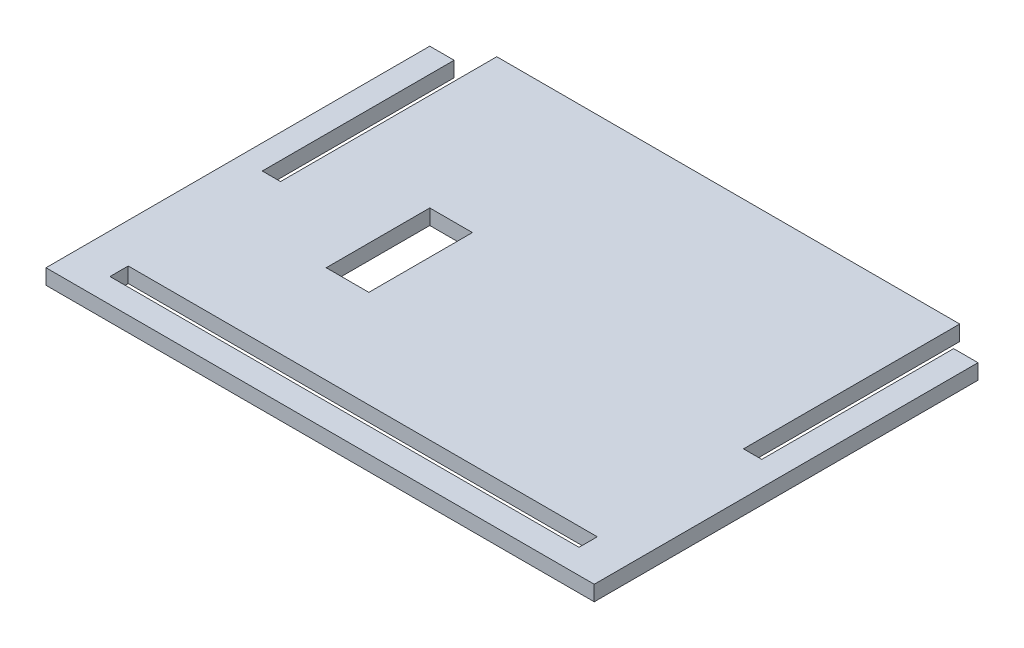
ISO-10303-21;
HEADER;
FILE_DESCRIPTION(('STEP AP214'),'2;1');
FILE_NAME('part.step','',(''),(''),'','','');
FILE_SCHEMA(('AUTOMOTIVE_DESIGN { 1 0 10303 214 1 1 1 1 }'));
ENDSEC;
DATA;
#1=APPLICATION_CONTEXT('core data for automotive mechanical design processes');
#2=APPLICATION_PROTOCOL_DEFINITION('international standard','automotive_design',2000,#1);
#3=PRODUCT_CONTEXT('',#1,'mechanical');
#4=PRODUCT('Part','Part','',(#3));
#5=PRODUCT_RELATED_PRODUCT_CATEGORY('part','',(#4));
#6=PRODUCT_DEFINITION_FORMATION('','',#4);
#7=PRODUCT_DEFINITION_CONTEXT('part definition',#1,'design');
#8=PRODUCT_DEFINITION('design','',#6,#7);
#9=PRODUCT_DEFINITION_SHAPE('','',#8);
#10=(LENGTH_UNIT() NAMED_UNIT(*) SI_UNIT(.MILLI.,.METRE.));
#11=(NAMED_UNIT(*) PLANE_ANGLE_UNIT() SI_UNIT($,.RADIAN.));
#12=(NAMED_UNIT(*) SI_UNIT($,.STERADIAN.) SOLID_ANGLE_UNIT());
#13=UNCERTAINTY_MEASURE_WITH_UNIT(LENGTH_MEASURE(1.E-05),#10,'distance_accuracy_value','');
#14=(GEOMETRIC_REPRESENTATION_CONTEXT(3) GLOBAL_UNCERTAINTY_ASSIGNED_CONTEXT((#13)) GLOBAL_UNIT_ASSIGNED_CONTEXT((#10,
#11,#12)) REPRESENTATION_CONTEXT('',''));
#15=CARTESIAN_POINT('',(0.,0.,0.));
#16=DIRECTION('',(0.,0.,1.));
#17=DIRECTION('',(1.,0.,0.));
#18=AXIS2_PLACEMENT_3D('',#15,#16,#17);
#19=CARTESIAN_POINT('',(0.,2.5,0.));
#20=DIRECTION('',(0.,1.,0.));
#21=DIRECTION('',(0.,0.,1.));
#22=AXIS2_PLACEMENT_3D('',#19,#20,#21);
#23=PLANE('',#22);
#24=DIRECTION('',(0.,0.,1.));
#25=VECTOR('',#24,1.);
#26=CARTESIAN_POINT('',(-22.,2.5,-7.50000000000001));
#27=LINE('',#26,#25);
#28=CARTESIAN_POINT('',(-22.,2.5,-8.50000000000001));
#29=VERTEX_POINT('',#28);
#30=CARTESIAN_POINT('',(-22.,2.5,8.49999999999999));
#31=VERTEX_POINT('',#30);
#32=EDGE_CURVE('E190',#29,#31,#27,.T.);
#33=ORIENTED_EDGE('',*,*,#32,.F.);
#34=DIRECTION('',(-1.,0.,0.));
#35=VECTOR('',#34,1.);
#36=CARTESIAN_POINT('',(-22.,2.5,-8.50000000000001));
#37=LINE('',#36,#35);
#38=CARTESIAN_POINT('',(-15.,2.5,-8.50000000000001));
#39=VERTEX_POINT('',#38);
#40=EDGE_CURVE('E199',#39,#29,#37,.T.);
#41=ORIENTED_EDGE('',*,*,#40,.F.);
#42=DIRECTION('',(0.,0.,-1.));
#43=VECTOR('',#42,1.);
#44=CARTESIAN_POINT('',(-15.,2.5,-7.50000000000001));
#45=LINE('',#44,#43);
#46=CARTESIAN_POINT('',(-15.,2.5,8.49999999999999));
#47=VERTEX_POINT('',#46);
#48=EDGE_CURVE('E184',#47,#39,#45,.T.);
#49=ORIENTED_EDGE('',*,*,#48,.F.);
#50=DIRECTION('',(1.,0.,0.));
#51=VECTOR('',#50,1.);
#52=CARTESIAN_POINT('',(-22.,2.5,8.49999999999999));
#53=LINE('',#52,#51);
#54=EDGE_CURVE('E203',#31,#47,#53,.T.);
#55=ORIENTED_EDGE('',*,*,#54,.F.);
#56=EDGE_LOOP('',(#33,#41,#49,#55));
#57=FACE_BOUND('',#56,.T.);
#58=DIRECTION('',(-1.,0.,0.));
#59=VECTOR('',#58,1.);
#60=CARTESIAN_POINT('',(-38.5,2.5,24.5));
#61=LINE('',#60,#59);
#62=CARTESIAN_POINT('',(38.5,2.5,24.5));
#63=VERTEX_POINT('',#62);
#64=CARTESIAN_POINT('',(-38.5,2.5,24.5));
#65=VERTEX_POINT('',#64);
#66=EDGE_CURVE('E230',#63,#65,#61,.T.);
#67=ORIENTED_EDGE('',*,*,#66,.F.);
#68=DIRECTION('',(0.,0.,-1.));
#69=VECTOR('',#68,1.);
#70=CARTESIAN_POINT('',(38.5,2.5,24.5));
#71=LINE('',#70,#69);
#72=CARTESIAN_POINT('',(38.5,2.5,27.5));
#73=VERTEX_POINT('',#72);
#74=EDGE_CURVE('E228',#73,#63,#71,.T.);
#75=ORIENTED_EDGE('',*,*,#74,.F.);
#76=DIRECTION('',(1.,0.,0.));
#77=VECTOR('',#76,1.);
#78=CARTESIAN_POINT('',(-38.5,2.5,27.5));
#79=LINE('',#78,#77);
#80=CARTESIAN_POINT('',(-38.5,2.5,27.5));
#81=VERTEX_POINT('',#80);
#82=EDGE_CURVE('E235',#81,#73,#79,.T.);
#83=ORIENTED_EDGE('',*,*,#82,.F.);
#84=DIRECTION('',(0.,0.,1.));
#85=VECTOR('',#84,1.);
#86=CARTESIAN_POINT('',(-38.5,2.5,24.5));
#87=LINE('',#86,#85);
#88=EDGE_CURVE('E233',#65,#81,#87,.T.);
#89=ORIENTED_EDGE('',*,*,#88,.F.);
#90=EDGE_LOOP('',(#67,#75,#83,#89));
#91=FACE_BOUND('',#90,.T.);
#92=DIRECTION('',(0.,0.,-1.));
#93=VECTOR('',#92,1.);
#94=CARTESIAN_POINT('',(45.,2.5,-31.5));
#95=LINE('',#94,#93);
#96=CARTESIAN_POINT('',(45.,2.5,31.5));
#97=VERTEX_POINT('',#96);
#98=CARTESIAN_POINT('',(45.,2.5,-31.5));
#99=VERTEX_POINT('',#98);
#100=EDGE_CURVE('E254',#97,#99,#95,.T.);
#101=ORIENTED_EDGE('',*,*,#100,.T.);
#102=DIRECTION('',(-1.,0.,0.));
#103=VECTOR('',#102,1.);
#104=CARTESIAN_POINT('',(41.,2.5,-31.5));
#105=LINE('',#104,#103);
#106=CARTESIAN_POINT('',(41.,2.5,-31.5));
#107=VERTEX_POINT('',#106);
#108=EDGE_CURVE('E257',#99,#107,#105,.T.);
#109=ORIENTED_EDGE('',*,*,#108,.T.);
#110=DIRECTION('',(0.,0.,1.));
#111=VECTOR('',#110,1.);
#112=CARTESIAN_POINT('',(41.,2.5,-31.5));
#113=LINE('',#112,#111);
#114=CARTESIAN_POINT('',(41.,2.5,0.));
#115=VERTEX_POINT('',#114);
#116=EDGE_CURVE('E260',#107,#115,#113,.T.);
#117=ORIENTED_EDGE('',*,*,#116,.T.);
#118=DIRECTION('',(-1.,0.,0.));
#119=VECTOR('',#118,1.);
#120=CARTESIAN_POINT('',(41.,2.5,0.));
#121=LINE('',#120,#119);
#122=CARTESIAN_POINT('',(38.,2.5,0.));
#123=VERTEX_POINT('',#122);
#124=EDGE_CURVE('E262',#115,#123,#121,.T.);
#125=ORIENTED_EDGE('',*,*,#124,.T.);
#126=DIRECTION('',(0.,0.,-1.));
#127=VECTOR('',#126,1.);
#128=CARTESIAN_POINT('',(38.,2.5,0.));
#129=LINE('',#128,#127);
#130=CARTESIAN_POINT('',(38.,2.5,-35.5));
#131=VERTEX_POINT('',#130);
#132=EDGE_CURVE('E264',#123,#131,#129,.T.);
#133=ORIENTED_EDGE('',*,*,#132,.T.);
#134=DIRECTION('',(-1.,0.,0.));
#135=VECTOR('',#134,1.);
#136=CARTESIAN_POINT('',(-38.,2.5,-35.5));
#137=LINE('',#136,#135);
#138=CARTESIAN_POINT('',(-38.,2.5,-35.5));
#139=VERTEX_POINT('',#138);
#140=EDGE_CURVE('E209',#131,#139,#137,.T.);
#141=ORIENTED_EDGE('',*,*,#140,.T.);
#142=DIRECTION('',(0.,0.,1.));
#143=VECTOR('',#142,1.);
#144=CARTESIAN_POINT('',(-38.,2.5,0.));
#145=LINE('',#144,#143);
#146=CARTESIAN_POINT('',(-38.,2.5,0.));
#147=VERTEX_POINT('',#146);
#148=EDGE_CURVE('E266',#139,#147,#145,.T.);
#149=ORIENTED_EDGE('',*,*,#148,.T.);
#150=DIRECTION('',(-1.,0.,0.));
#151=VECTOR('',#150,1.);
#152=CARTESIAN_POINT('',(-41.,2.5,0.));
#153=LINE('',#152,#151);
#154=CARTESIAN_POINT('',(-41.,2.5,0.));
#155=VERTEX_POINT('',#154);
#156=EDGE_CURVE('E268',#147,#155,#153,.T.);
#157=ORIENTED_EDGE('',*,*,#156,.T.);
#158=DIRECTION('',(0.,0.,-1.));
#159=VECTOR('',#158,1.);
#160=CARTESIAN_POINT('',(-41.,2.5,-31.5));
#161=LINE('',#160,#159);
#162=CARTESIAN_POINT('',(-41.,2.5,-31.5));
#163=VERTEX_POINT('',#162);
#164=EDGE_CURVE('E270',#155,#163,#161,.T.);
#165=ORIENTED_EDGE('',*,*,#164,.T.);
#166=DIRECTION('',(-1.,0.,0.));
#167=VECTOR('',#166,1.);
#168=CARTESIAN_POINT('',(-45.,2.5,-31.5));
#169=LINE('',#168,#167);
#170=CARTESIAN_POINT('',(-45.,2.5,-31.5));
#171=VERTEX_POINT('',#170);
#172=EDGE_CURVE('E272',#163,#171,#169,.T.);
#173=ORIENTED_EDGE('',*,*,#172,.T.);
#174=DIRECTION('',(0.,0.,1.));
#175=VECTOR('',#174,1.);
#176=CARTESIAN_POINT('',(-45.,2.5,-31.5));
#177=LINE('',#176,#175);
#178=CARTESIAN_POINT('',(-45.,2.5,31.5));
#179=VERTEX_POINT('',#178);
#180=EDGE_CURVE('E274',#171,#179,#177,.T.);
#181=ORIENTED_EDGE('',*,*,#180,.T.);
#182=DIRECTION('',(1.,0.,0.));
#183=VECTOR('',#182,1.);
#184=CARTESIAN_POINT('',(-45.,2.5,31.5));
#185=LINE('',#184,#183);
#186=EDGE_CURVE('E276',#179,#97,#185,.T.);
#187=ORIENTED_EDGE('',*,*,#186,.T.);
#188=EDGE_LOOP('',(#101,#109,#117,#125,#133,#141,#149,#157,#165,#173,#181,#187));
#189=FACE_BOUND('',#188,.T.);
#190=ADVANCED_FACE('F34',(#57,#91,#189),#23,.T.);
#191=CARTESIAN_POINT('',(0.,0.,0.));
#192=DIRECTION('',(0.,1.,0.));
#193=DIRECTION('',(0.,0.,1.));
#194=AXIS2_PLACEMENT_3D('',#191,#192,#193);
#195=PLANE('',#194);
#196=DIRECTION('',(-1.,0.,0.));
#197=VECTOR('',#196,1.);
#198=CARTESIAN_POINT('',(-22.,0.,-8.50000000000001));
#199=LINE('',#198,#197);
#200=CARTESIAN_POINT('',(-15.,0.,-8.50000000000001));
#201=VERTEX_POINT('',#200);
#202=CARTESIAN_POINT('',(-22.,0.,-8.50000000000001));
#203=VERTEX_POINT('',#202);
#204=EDGE_CURVE('E180',#201,#203,#199,.T.);
#205=ORIENTED_EDGE('',*,*,#204,.T.);
#206=DIRECTION('',(0.,0.,1.));
#207=VECTOR('',#206,1.);
#208=CARTESIAN_POINT('',(-22.,0.,-7.50000000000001));
#209=LINE('',#208,#207);
#210=CARTESIAN_POINT('',(-22.,0.,8.49999999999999));
#211=VERTEX_POINT('',#210);
#212=EDGE_CURVE('E173',#203,#211,#209,.T.);
#213=ORIENTED_EDGE('',*,*,#212,.T.);
#214=DIRECTION('',(1.,0.,0.));
#215=VECTOR('',#214,1.);
#216=CARTESIAN_POINT('',(-22.,0.,8.49999999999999));
#217=LINE('',#216,#215);
#218=CARTESIAN_POINT('',(-15.,0.,8.49999999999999));
#219=VERTEX_POINT('',#218);
#220=EDGE_CURVE('E178',#211,#219,#217,.T.);
#221=ORIENTED_EDGE('',*,*,#220,.T.);
#222=DIRECTION('',(0.,0.,-1.));
#223=VECTOR('',#222,1.);
#224=CARTESIAN_POINT('',(-15.,0.,-7.50000000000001));
#225=LINE('',#224,#223);
#226=EDGE_CURVE('E185',#219,#201,#225,.T.);
#227=ORIENTED_EDGE('',*,*,#226,.T.);
#228=EDGE_LOOP('',(#205,#213,#221,#227));
#229=FACE_BOUND('',#228,.T.);
#230=DIRECTION('',(0.,0.,-1.));
#231=VECTOR('',#230,1.);
#232=CARTESIAN_POINT('',(38.5,0.,24.5));
#233=LINE('',#232,#231);
#234=CARTESIAN_POINT('',(38.5,0.,27.5));
#235=VERTEX_POINT('',#234);
#236=CARTESIAN_POINT('',(38.5,0.,24.5));
#237=VERTEX_POINT('',#236);
#238=EDGE_CURVE('E57',#235,#237,#233,.T.);
#239=ORIENTED_EDGE('',*,*,#238,.T.);
#240=DIRECTION('',(-1.,0.,0.));
#241=VECTOR('',#240,1.);
#242=CARTESIAN_POINT('',(-38.5,0.,24.5));
#243=LINE('',#242,#241);
#244=CARTESIAN_POINT('',(-38.5,0.,24.5));
#245=VERTEX_POINT('',#244);
#246=EDGE_CURVE('E239',#237,#245,#243,.T.);
#247=ORIENTED_EDGE('',*,*,#246,.T.);
#248=DIRECTION('',(0.,0.,1.));
#249=VECTOR('',#248,1.);
#250=CARTESIAN_POINT('',(-38.5,0.,24.5));
#251=LINE('',#250,#249);
#252=CARTESIAN_POINT('',(-38.5,0.,27.5));
#253=VERTEX_POINT('',#252);
#254=EDGE_CURVE('E242',#245,#253,#251,.T.);
#255=ORIENTED_EDGE('',*,*,#254,.T.);
#256=DIRECTION('',(1.,0.,0.));
#257=VECTOR('',#256,1.);
#258=CARTESIAN_POINT('',(-38.5,0.,27.5));
#259=LINE('',#258,#257);
#260=EDGE_CURVE('E231',#253,#235,#259,.T.);
#261=ORIENTED_EDGE('',*,*,#260,.T.);
#262=EDGE_LOOP('',(#239,#247,#255,#261));
#263=FACE_BOUND('',#262,.T.);
#264=DIRECTION('',(0.,0.,-1.));
#265=VECTOR('',#264,1.);
#266=CARTESIAN_POINT('',(45.,0.,-31.5));
#267=LINE('',#266,#265);
#268=CARTESIAN_POINT('',(45.,0.,31.5));
#269=VERTEX_POINT('',#268);
#270=CARTESIAN_POINT('',(45.,0.,-31.5));
#271=VERTEX_POINT('',#270);
#272=EDGE_CURVE('E253',#269,#271,#267,.T.);
#273=ORIENTED_EDGE('',*,*,#272,.F.);
#274=DIRECTION('',(1.,0.,0.));
#275=VECTOR('',#274,1.);
#276=CARTESIAN_POINT('',(-45.,0.,31.5));
#277=LINE('',#276,#275);
#278=CARTESIAN_POINT('',(-45.,0.,31.5));
#279=VERTEX_POINT('',#278);
#280=EDGE_CURVE('E258',#279,#269,#277,.T.);
#281=ORIENTED_EDGE('',*,*,#280,.F.);
#282=DIRECTION('',(0.,0.,1.));
#283=VECTOR('',#282,1.);
#284=CARTESIAN_POINT('',(-45.,0.,-31.5));
#285=LINE('',#284,#283);
#286=CARTESIAN_POINT('',(-45.,0.,-31.5));
#287=VERTEX_POINT('',#286);
#288=EDGE_CURVE('E297',#287,#279,#285,.T.);
#289=ORIENTED_EDGE('',*,*,#288,.F.);
#290=DIRECTION('',(-1.,0.,0.));
#291=VECTOR('',#290,1.);
#292=CARTESIAN_POINT('',(-45.,0.,-31.5));
#293=LINE('',#292,#291);
#294=CARTESIAN_POINT('',(-41.,0.,-31.5));
#295=VERTEX_POINT('',#294);
#296=EDGE_CURVE('E295',#295,#287,#293,.T.);
#297=ORIENTED_EDGE('',*,*,#296,.F.);
#298=DIRECTION('',(0.,0.,-1.));
#299=VECTOR('',#298,1.);
#300=CARTESIAN_POINT('',(-41.,0.,-31.5));
#301=LINE('',#300,#299);
#302=CARTESIAN_POINT('',(-41.,0.,0.));
#303=VERTEX_POINT('',#302);
#304=EDGE_CURVE('E293',#303,#295,#301,.T.);
#305=ORIENTED_EDGE('',*,*,#304,.F.);
#306=DIRECTION('',(-1.,0.,0.));
#307=VECTOR('',#306,1.);
#308=CARTESIAN_POINT('',(-41.,0.,0.));
#309=LINE('',#308,#307);
#310=CARTESIAN_POINT('',(-38.,0.,0.));
#311=VERTEX_POINT('',#310);
#312=EDGE_CURVE('E291',#311,#303,#309,.T.);
#313=ORIENTED_EDGE('',*,*,#312,.F.);
#314=DIRECTION('',(0.,0.,1.));
#315=VECTOR('',#314,1.);
#316=CARTESIAN_POINT('',(-38.,0.,0.));
#317=LINE('',#316,#315);
#318=CARTESIAN_POINT('',(-38.,0.,-35.5));
#319=VERTEX_POINT('',#318);
#320=EDGE_CURVE('E289',#319,#311,#317,.T.);
#321=ORIENTED_EDGE('',*,*,#320,.F.);
#322=DIRECTION('',(-1.,0.,0.));
#323=VECTOR('',#322,1.);
#324=CARTESIAN_POINT('',(-38.,0.,-35.5));
#325=LINE('',#324,#323);
#326=CARTESIAN_POINT('',(38.,0.,-35.5));
#327=VERTEX_POINT('',#326);
#328=EDGE_CURVE('E214',#327,#319,#325,.T.);
#329=ORIENTED_EDGE('',*,*,#328,.F.);
#330=DIRECTION('',(0.,0.,-1.));
#331=VECTOR('',#330,1.);
#332=CARTESIAN_POINT('',(38.,0.,0.));
#333=LINE('',#332,#331);
#334=CARTESIAN_POINT('',(38.,0.,0.));
#335=VERTEX_POINT('',#334);
#336=EDGE_CURVE('E287',#335,#327,#333,.T.);
#337=ORIENTED_EDGE('',*,*,#336,.F.);
#338=DIRECTION('',(-1.,0.,0.));
#339=VECTOR('',#338,1.);
#340=CARTESIAN_POINT('',(41.,0.,0.));
#341=LINE('',#340,#339);
#342=CARTESIAN_POINT('',(41.,0.,0.));
#343=VERTEX_POINT('',#342);
#344=EDGE_CURVE('E285',#343,#335,#341,.T.);
#345=ORIENTED_EDGE('',*,*,#344,.F.);
#346=DIRECTION('',(0.,0.,1.));
#347=VECTOR('',#346,1.);
#348=CARTESIAN_POINT('',(41.,0.,-31.5));
#349=LINE('',#348,#347);
#350=CARTESIAN_POINT('',(41.,0.,-31.5));
#351=VERTEX_POINT('',#350);
#352=EDGE_CURVE('E283',#351,#343,#349,.T.);
#353=ORIENTED_EDGE('',*,*,#352,.F.);
#354=DIRECTION('',(-1.,0.,0.));
#355=VECTOR('',#354,1.);
#356=CARTESIAN_POINT('',(41.,0.,-31.5));
#357=LINE('',#356,#355);
#358=EDGE_CURVE('E281',#271,#351,#357,.T.);
#359=ORIENTED_EDGE('',*,*,#358,.F.);
#360=EDGE_LOOP('',(#273,#281,#289,#297,#305,#313,#321,#329,#337,#345,#353,#359));
#361=FACE_BOUND('',#360,.T.);
#362=ADVANCED_FACE('F175',(#229,#263,#361),#195,.F.);
#363=CARTESIAN_POINT('',(45.,2.5,-31.5));
#364=DIRECTION('',(-1.,0.,0.));
#365=DIRECTION('',(0.,0.,1.));
#366=AXIS2_PLACEMENT_3D('',#363,#364,#365);
#367=PLANE('',#366);
#368=ORIENTED_EDGE('',*,*,#272,.T.);
#369=DIRECTION('',(0.,-1.,0.));
#370=VECTOR('',#369,1.);
#371=CARTESIAN_POINT('',(45.,2.5,-31.5));
#372=LINE('',#371,#370);
#373=EDGE_CURVE('E11',#99,#271,#372,.T.);
#374=ORIENTED_EDGE('',*,*,#373,.F.);
#375=ORIENTED_EDGE('',*,*,#100,.F.);
#376=DIRECTION('',(0.,-1.,0.));
#377=VECTOR('',#376,1.);
#378=CARTESIAN_POINT('',(45.,2.5,31.5));
#379=LINE('',#378,#377);
#380=EDGE_CURVE('E278',#97,#269,#379,.T.);
#381=ORIENTED_EDGE('',*,*,#380,.T.);
#382=EDGE_LOOP('',(#368,#374,#375,#381));
#383=FACE_BOUND('',#382,.T.);
#384=ADVANCED_FACE('F36',(#383),#367,.F.);
#385=CARTESIAN_POINT('',(41.,2.5,-31.5));
#386=DIRECTION('',(0.,0.,1.));
#387=DIRECTION('',(1.,0.,0.));
#388=AXIS2_PLACEMENT_3D('',#385,#386,#387);
#389=PLANE('',#388);
#390=ORIENTED_EDGE('',*,*,#358,.T.);
#391=DIRECTION('',(0.,-1.,0.));
#392=VECTOR('',#391,1.);
#393=CARTESIAN_POINT('',(41.,2.5,-31.5));
#394=LINE('',#393,#392);
#395=EDGE_CURVE('E42',#107,#351,#394,.T.);
#396=ORIENTED_EDGE('',*,*,#395,.F.);
#397=ORIENTED_EDGE('',*,*,#108,.F.);
#398=ORIENTED_EDGE('',*,*,#373,.T.);
#399=EDGE_LOOP('',(#390,#396,#397,#398));
#400=FACE_BOUND('',#399,.T.);
#401=ADVANCED_FACE('F347',(#400),#389,.F.);
#402=CARTESIAN_POINT('',(41.,2.5,-31.5));
#403=DIRECTION('',(1.,0.,0.));
#404=DIRECTION('',(0.,0.,-1.));
#405=AXIS2_PLACEMENT_3D('',#402,#403,#404);
#406=PLANE('',#405);
#407=ORIENTED_EDGE('',*,*,#352,.T.);
#408=DIRECTION('',(0.,-1.,0.));
#409=VECTOR('',#408,1.);
#410=CARTESIAN_POINT('',(41.,2.5,0.));
#411=LINE('',#410,#409);
#412=EDGE_CURVE('E320',#115,#343,#411,.T.);
#413=ORIENTED_EDGE('',*,*,#412,.F.);
#414=ORIENTED_EDGE('',*,*,#116,.F.);
#415=ORIENTED_EDGE('',*,*,#395,.T.);
#416=EDGE_LOOP('',(#407,#413,#414,#415));
#417=FACE_BOUND('',#416,.T.);
#418=ADVANCED_FACE('F327',(#417),#406,.F.);
#419=CARTESIAN_POINT('',(41.,2.5,0.));
#420=DIRECTION('',(0.,0.,1.));
#421=DIRECTION('',(1.,0.,0.));
#422=AXIS2_PLACEMENT_3D('',#419,#420,#421);
#423=PLANE('',#422);
#424=ORIENTED_EDGE('',*,*,#344,.T.);
#425=DIRECTION('',(0.,-1.,0.));
#426=VECTOR('',#425,1.);
#427=CARTESIAN_POINT('',(38.,2.5,0.));
#428=LINE('',#427,#426);
#429=EDGE_CURVE('E317',#123,#335,#428,.T.);
#430=ORIENTED_EDGE('',*,*,#429,.F.);
#431=ORIENTED_EDGE('',*,*,#124,.F.);
#432=ORIENTED_EDGE('',*,*,#412,.T.);
#433=EDGE_LOOP('',(#424,#430,#431,#432));
#434=FACE_BOUND('',#433,.T.);
#435=ADVANCED_FACE('F337',(#434),#423,.F.);
#436=CARTESIAN_POINT('',(38.,2.5,0.));
#437=DIRECTION('',(-1.,0.,0.));
#438=DIRECTION('',(0.,0.,1.));
#439=AXIS2_PLACEMENT_3D('',#436,#437,#438);
#440=PLANE('',#439);
#441=ORIENTED_EDGE('',*,*,#336,.T.);
#442=DIRECTION('',(0.,1.,0.));
#443=VECTOR('',#442,1.);
#444=CARTESIAN_POINT('',(38.,0.,-35.5));
#445=LINE('',#444,#443);
#446=EDGE_CURVE('E217',#327,#131,#445,.T.);
#447=ORIENTED_EDGE('',*,*,#446,.T.);
#448=ORIENTED_EDGE('',*,*,#132,.F.);
#449=ORIENTED_EDGE('',*,*,#429,.T.);
#450=EDGE_LOOP('',(#441,#447,#448,#449));
#451=FACE_BOUND('',#450,.T.);
#452=ADVANCED_FACE('F341',(#451),#440,.F.);
#453=CARTESIAN_POINT('',(-38.,2.5,0.));
#454=DIRECTION('',(1.,0.,0.));
#455=DIRECTION('',(0.,0.,-1.));
#456=AXIS2_PLACEMENT_3D('',#453,#454,#455);
#457=PLANE('',#456);
#458=ORIENTED_EDGE('',*,*,#320,.T.);
#459=DIRECTION('',(0.,-1.,0.));
#460=VECTOR('',#459,1.);
#461=CARTESIAN_POINT('',(-38.,2.5,0.));
#462=LINE('',#461,#460);
#463=EDGE_CURVE('E314',#147,#311,#462,.T.);
#464=ORIENTED_EDGE('',*,*,#463,.F.);
#465=ORIENTED_EDGE('',*,*,#148,.F.);
#466=DIRECTION('',(0.,1.,0.));
#467=VECTOR('',#466,1.);
#468=CARTESIAN_POINT('',(-38.,0.,-35.5));
#469=LINE('',#468,#467);
#470=EDGE_CURVE('E220',#319,#139,#469,.T.);
#471=ORIENTED_EDGE('',*,*,#470,.F.);
#472=EDGE_LOOP('',(#458,#464,#465,#471));
#473=FACE_BOUND('',#472,.T.);
#474=ADVANCED_FACE('F376',(#473),#457,.F.);
#475=CARTESIAN_POINT('',(-41.,2.5,0.));
#476=DIRECTION('',(0.,0.,1.));
#477=DIRECTION('',(1.,0.,0.));
#478=AXIS2_PLACEMENT_3D('',#475,#476,#477);
#479=PLANE('',#478);
#480=ORIENTED_EDGE('',*,*,#312,.T.);
#481=DIRECTION('',(0.,-1.,0.));
#482=VECTOR('',#481,1.);
#483=CARTESIAN_POINT('',(-41.,2.5,0.));
#484=LINE('',#483,#482);
#485=EDGE_CURVE('E311',#155,#303,#484,.T.);
#486=ORIENTED_EDGE('',*,*,#485,.F.);
#487=ORIENTED_EDGE('',*,*,#156,.F.);
#488=ORIENTED_EDGE('',*,*,#463,.T.);
#489=EDGE_LOOP('',(#480,#486,#487,#488));
#490=FACE_BOUND('',#489,.T.);
#491=ADVANCED_FACE('F373',(#490),#479,.F.);
#492=CARTESIAN_POINT('',(-41.,2.5,-31.5));
#493=DIRECTION('',(-1.,0.,0.));
#494=DIRECTION('',(0.,0.,1.));
#495=AXIS2_PLACEMENT_3D('',#492,#493,#494);
#496=PLANE('',#495);
#497=ORIENTED_EDGE('',*,*,#304,.T.);
#498=DIRECTION('',(0.,-1.,0.));
#499=VECTOR('',#498,1.);
#500=CARTESIAN_POINT('',(-41.,2.5,-31.5));
#501=LINE('',#500,#499);
#502=EDGE_CURVE('E308',#163,#295,#501,.T.);
#503=ORIENTED_EDGE('',*,*,#502,.F.);
#504=ORIENTED_EDGE('',*,*,#164,.F.);
#505=ORIENTED_EDGE('',*,*,#485,.T.);
#506=EDGE_LOOP('',(#497,#503,#504,#505));
#507=FACE_BOUND('',#506,.T.);
#508=ADVANCED_FACE('F368',(#507),#496,.F.);
#509=CARTESIAN_POINT('',(-45.,2.5,-31.5));
#510=DIRECTION('',(0.,0.,1.));
#511=DIRECTION('',(1.,0.,0.));
#512=AXIS2_PLACEMENT_3D('',#509,#510,#511);
#513=PLANE('',#512);
#514=ORIENTED_EDGE('',*,*,#296,.T.);
#515=DIRECTION('',(0.,-1.,0.));
#516=VECTOR('',#515,1.);
#517=CARTESIAN_POINT('',(-45.,2.5,-31.5));
#518=LINE('',#517,#516);
#519=EDGE_CURVE('E305',#171,#287,#518,.T.);
#520=ORIENTED_EDGE('',*,*,#519,.F.);
#521=ORIENTED_EDGE('',*,*,#172,.F.);
#522=ORIENTED_EDGE('',*,*,#502,.T.);
#523=EDGE_LOOP('',(#514,#520,#521,#522));
#524=FACE_BOUND('',#523,.T.);
#525=ADVANCED_FACE('F363',(#524),#513,.F.);
#526=CARTESIAN_POINT('',(-45.,2.5,-31.5));
#527=DIRECTION('',(1.,0.,0.));
#528=DIRECTION('',(0.,0.,-1.));
#529=AXIS2_PLACEMENT_3D('',#526,#527,#528);
#530=PLANE('',#529);
#531=ORIENTED_EDGE('',*,*,#288,.T.);
#532=DIRECTION('',(0.,-1.,0.));
#533=VECTOR('',#532,1.);
#534=CARTESIAN_POINT('',(-45.,2.5,31.5));
#535=LINE('',#534,#533);
#536=EDGE_CURVE('E302',#179,#279,#535,.T.);
#537=ORIENTED_EDGE('',*,*,#536,.F.);
#538=ORIENTED_EDGE('',*,*,#180,.F.);
#539=ORIENTED_EDGE('',*,*,#519,.T.);
#540=EDGE_LOOP('',(#531,#537,#538,#539));
#541=FACE_BOUND('',#540,.T.);
#542=ADVANCED_FACE('F359',(#541),#530,.F.);
#543=CARTESIAN_POINT('',(-45.,2.5,31.5));
#544=DIRECTION('',(0.,0.,-1.));
#545=DIRECTION('',(-1.,0.,0.));
#546=AXIS2_PLACEMENT_3D('',#543,#544,#545);
#547=PLANE('',#546);
#548=ORIENTED_EDGE('',*,*,#280,.T.);
#549=ORIENTED_EDGE('',*,*,#380,.F.);
#550=ORIENTED_EDGE('',*,*,#186,.F.);
#551=ORIENTED_EDGE('',*,*,#536,.T.);
#552=EDGE_LOOP('',(#548,#549,#550,#551));
#553=FACE_BOUND('',#552,.T.);
#554=ADVANCED_FACE('F354',(#553),#547,.F.);
#555=CARTESIAN_POINT('',(38.5,2.5,24.5));
#556=DIRECTION('',(-1.,0.,0.));
#557=DIRECTION('',(0.,0.,1.));
#558=AXIS2_PLACEMENT_3D('',#555,#556,#557);
#559=PLANE('',#558);
#560=ORIENTED_EDGE('',*,*,#238,.F.);
#561=DIRECTION('',(0.,-1.,0.));
#562=VECTOR('',#561,1.);
#563=CARTESIAN_POINT('',(38.5,2.5,27.5));
#564=LINE('',#563,#562);
#565=EDGE_CURVE('E237',#73,#235,#564,.T.);
#566=ORIENTED_EDGE('',*,*,#565,.F.);
#567=ORIENTED_EDGE('',*,*,#74,.T.);
#568=DIRECTION('',(0.,-1.,0.));
#569=VECTOR('',#568,1.);
#570=CARTESIAN_POINT('',(38.5,2.5,24.5));
#571=LINE('',#570,#569);
#572=EDGE_CURVE('E251',#63,#237,#571,.T.);
#573=ORIENTED_EDGE('',*,*,#572,.T.);
#574=EDGE_LOOP('',(#560,#566,#567,#573));
#575=FACE_BOUND('',#574,.T.);
#576=ADVANCED_FACE('F399',(#575),#559,.T.);
#577=CARTESIAN_POINT('',(-38.5,2.5,24.5));
#578=DIRECTION('',(0.,0.,1.));
#579=DIRECTION('',(1.,0.,0.));
#580=AXIS2_PLACEMENT_3D('',#577,#578,#579);
#581=PLANE('',#580);
#582=ORIENTED_EDGE('',*,*,#246,.F.);
#583=ORIENTED_EDGE('',*,*,#572,.F.);
#584=ORIENTED_EDGE('',*,*,#66,.T.);
#585=DIRECTION('',(0.,-1.,0.));
#586=VECTOR('',#585,1.);
#587=CARTESIAN_POINT('',(-38.5,2.5,24.5));
#588=LINE('',#587,#586);
#589=EDGE_CURVE('E249',#65,#245,#588,.T.);
#590=ORIENTED_EDGE('',*,*,#589,.T.);
#591=EDGE_LOOP('',(#582,#583,#584,#590));
#592=FACE_BOUND('',#591,.T.);
#593=ADVANCED_FACE('F493',(#592),#581,.T.);
#594=CARTESIAN_POINT('',(-38.5,2.5,24.5));
#595=DIRECTION('',(1.,0.,0.));
#596=DIRECTION('',(0.,0.,-1.));
#597=AXIS2_PLACEMENT_3D('',#594,#595,#596);
#598=PLANE('',#597);
#599=ORIENTED_EDGE('',*,*,#254,.F.);
#600=ORIENTED_EDGE('',*,*,#589,.F.);
#601=ORIENTED_EDGE('',*,*,#88,.T.);
#602=DIRECTION('',(0.,-1.,0.));
#603=VECTOR('',#602,1.);
#604=CARTESIAN_POINT('',(-38.5,2.5,27.5));
#605=LINE('',#604,#603);
#606=EDGE_CURVE('E49',#81,#253,#605,.T.);
#607=ORIENTED_EDGE('',*,*,#606,.T.);
#608=EDGE_LOOP('',(#599,#600,#601,#607));
#609=FACE_BOUND('',#608,.T.);
#610=ADVANCED_FACE('F484',(#609),#598,.T.);
#611=CARTESIAN_POINT('',(-38.5,2.5,27.5));
#612=DIRECTION('',(0.,0.,-1.));
#613=DIRECTION('',(-1.,0.,0.));
#614=AXIS2_PLACEMENT_3D('',#611,#612,#613);
#615=PLANE('',#614);
#616=ORIENTED_EDGE('',*,*,#260,.F.);
#617=ORIENTED_EDGE('',*,*,#606,.F.);
#618=ORIENTED_EDGE('',*,*,#82,.T.);
#619=ORIENTED_EDGE('',*,*,#565,.T.);
#620=EDGE_LOOP('',(#616,#617,#618,#619));
#621=FACE_BOUND('',#620,.T.);
#622=ADVANCED_FACE('F445',(#621),#615,.T.);
#623=CARTESIAN_POINT('',(-15.,2.5,-7.50000000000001));
#624=DIRECTION('',(-1.,0.,0.));
#625=DIRECTION('',(0.,0.,1.));
#626=AXIS2_PLACEMENT_3D('',#623,#624,#625);
#627=PLANE('',#626);
#628=ORIENTED_EDGE('',*,*,#226,.F.);
#629=DIRECTION('',(0.,1.,0.));
#630=VECTOR('',#629,1.);
#631=CARTESIAN_POINT('',(-15.,0.,8.49999999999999));
#632=LINE('',#631,#630);
#633=EDGE_CURVE('E194',#219,#47,#632,.T.);
#634=ORIENTED_EDGE('',*,*,#633,.T.);
#635=ORIENTED_EDGE('',*,*,#48,.T.);
#636=DIRECTION('',(0.,1.,0.));
#637=VECTOR('',#636,1.);
#638=CARTESIAN_POINT('',(-15.,0.,-8.50000000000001));
#639=LINE('',#638,#637);
#640=EDGE_CURVE('E210',#201,#39,#639,.T.);
#641=ORIENTED_EDGE('',*,*,#640,.F.);
#642=EDGE_LOOP('',(#628,#634,#635,#641));
#643=FACE_BOUND('',#642,.T.);
#644=ADVANCED_FACE('F388',(#643),#627,.T.);
#645=CARTESIAN_POINT('',(-22.,2.5,-7.50000000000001));
#646=DIRECTION('',(1.,0.,0.));
#647=DIRECTION('',(0.,0.,-1.));
#648=AXIS2_PLACEMENT_3D('',#645,#646,#647);
#649=PLANE('',#648);
#650=ORIENTED_EDGE('',*,*,#212,.F.);
#651=DIRECTION('',(0.,1.,0.));
#652=VECTOR('',#651,1.);
#653=CARTESIAN_POINT('',(-22.,0.,-8.50000000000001));
#654=LINE('',#653,#652);
#655=EDGE_CURVE('E207',#203,#29,#654,.T.);
#656=ORIENTED_EDGE('',*,*,#655,.T.);
#657=ORIENTED_EDGE('',*,*,#32,.T.);
#658=DIRECTION('',(0.,1.,0.));
#659=VECTOR('',#658,1.);
#660=CARTESIAN_POINT('',(-22.,0.,8.49999999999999));
#661=LINE('',#660,#659);
#662=EDGE_CURVE('E188',#211,#31,#661,.T.);
#663=ORIENTED_EDGE('',*,*,#662,.F.);
#664=EDGE_LOOP('',(#650,#656,#657,#663));
#665=FACE_BOUND('',#664,.T.);
#666=ADVANCED_FACE('F189',(#665),#649,.T.);
#667=CARTESIAN_POINT('',(-38.,0.,-35.5));
#668=DIRECTION('',(0.,0.,-1.));
#669=DIRECTION('',(-1.,0.,0.));
#670=AXIS2_PLACEMENT_3D('',#667,#668,#669);
#671=PLANE('',#670);
#672=ORIENTED_EDGE('',*,*,#140,.F.);
#673=ORIENTED_EDGE('',*,*,#446,.F.);
#674=ORIENTED_EDGE('',*,*,#328,.T.);
#675=ORIENTED_EDGE('',*,*,#470,.T.);
#676=EDGE_LOOP('',(#672,#673,#674,#675));
#677=FACE_BOUND('',#676,.T.);
#678=ADVANCED_FACE('F379',(#677),#671,.T.);
#679=CARTESIAN_POINT('',(-22.,0.,8.49999999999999));
#680=DIRECTION('',(0.,0.,1.));
#681=DIRECTION('',(1.,0.,0.));
#682=AXIS2_PLACEMENT_3D('',#679,#680,#681);
#683=PLANE('',#682);
#684=ORIENTED_EDGE('',*,*,#54,.T.);
#685=ORIENTED_EDGE('',*,*,#633,.F.);
#686=ORIENTED_EDGE('',*,*,#220,.F.);
#687=ORIENTED_EDGE('',*,*,#662,.T.);
#688=EDGE_LOOP('',(#684,#685,#686,#687));
#689=FACE_BOUND('',#688,.T.);
#690=ADVANCED_FACE('F197',(#689),#683,.F.);
#691=CARTESIAN_POINT('',(-22.,0.,-8.50000000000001));
#692=DIRECTION('',(0.,0.,-1.));
#693=DIRECTION('',(-1.,0.,0.));
#694=AXIS2_PLACEMENT_3D('',#691,#692,#693);
#695=PLANE('',#694);
#696=ORIENTED_EDGE('',*,*,#40,.T.);
#697=ORIENTED_EDGE('',*,*,#655,.F.);
#698=ORIENTED_EDGE('',*,*,#204,.F.);
#699=ORIENTED_EDGE('',*,*,#640,.T.);
#700=EDGE_LOOP('',(#696,#697,#698,#699));
#701=FACE_BOUND('',#700,.T.);
#702=ADVANCED_FACE('F386',(#701),#695,.F.);
#703=CLOSED_SHELL('',(#190,#362,#384,#401,#418,#435,#452,#474,#491,#508,#525,#542,#554,#576,
#593,#610,#622,#644,#666,#678,#690,#702));
#704=MANIFOLD_SOLID_BREP('B2',#703);
#705=ADVANCED_BREP_SHAPE_REPRESENTATION('',(#18,#704),#14);
#706=SHAPE_DEFINITION_REPRESENTATION(#9,#705);
ENDSEC;
END-ISO-10303-21;
